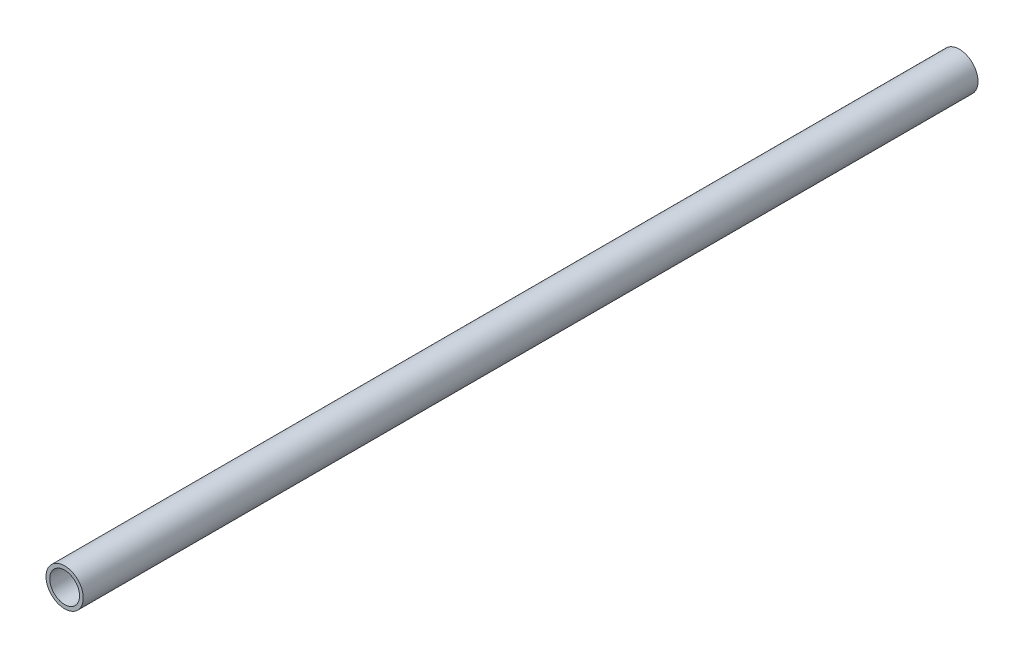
ISO-10303-21;
HEADER;
FILE_DESCRIPTION(('STEP AP214'),'2;1');
FILE_NAME('part.step','',(''),(''),'','','');
FILE_SCHEMA(('AUTOMOTIVE_DESIGN { 1 0 10303 214 1 1 1 1 }'));
ENDSEC;
DATA;
#1=APPLICATION_CONTEXT('core data for automotive mechanical design processes');
#2=APPLICATION_PROTOCOL_DEFINITION('international standard','automotive_design',2000,#1);
#3=PRODUCT_CONTEXT('',#1,'mechanical');
#4=PRODUCT('Part','Part','',(#3));
#5=PRODUCT_RELATED_PRODUCT_CATEGORY('part','',(#4));
#6=PRODUCT_DEFINITION_FORMATION('','',#4);
#7=PRODUCT_DEFINITION_CONTEXT('part definition',#1,'design');
#8=PRODUCT_DEFINITION('design','',#6,#7);
#9=PRODUCT_DEFINITION_SHAPE('','',#8);
#10=(LENGTH_UNIT() NAMED_UNIT(*) SI_UNIT(.MILLI.,.METRE.));
#11=(NAMED_UNIT(*) PLANE_ANGLE_UNIT() SI_UNIT($,.RADIAN.));
#12=(NAMED_UNIT(*) SI_UNIT($,.STERADIAN.) SOLID_ANGLE_UNIT());
#13=UNCERTAINTY_MEASURE_WITH_UNIT(LENGTH_MEASURE(1.E-05),#10,'distance_accuracy_value','');
#14=(GEOMETRIC_REPRESENTATION_CONTEXT(3) GLOBAL_UNCERTAINTY_ASSIGNED_CONTEXT((#13)) GLOBAL_UNIT_ASSIGNED_CONTEXT((#10,
#11,#12)) REPRESENTATION_CONTEXT('',''));
#15=CARTESIAN_POINT('',(0.,0.,0.));
#16=DIRECTION('',(0.,0.,1.));
#17=DIRECTION('',(1.,0.,0.));
#18=AXIS2_PLACEMENT_3D('',#15,#16,#17);
#19=CARTESIAN_POINT('',(0.,0.,152.4));
#20=DIRECTION('',(0.,0.,1.));
#21=DIRECTION('',(1.,0.,0.));
#22=AXIS2_PLACEMENT_3D('',#19,#20,#21);
#23=PLANE('',#22);
#24=CARTESIAN_POINT('',(0.,0.,152.4));
#25=DIRECTION('',(0.,0.,1.));
#26=DIRECTION('',(1.,0.,0.));
#27=AXIS2_PLACEMENT_3D('',#24,#25,#26);
#28=CIRCLE('',#27,6.35);
#29=CARTESIAN_POINT('',(-6.35,0.,152.4));
#30=VERTEX_POINT('',#29);
#31=EDGE_CURVE('E10',#30,#30,#28,.T.);
#32=ORIENTED_EDGE('',*,*,#31,.T.);
#33=EDGE_LOOP('',(#32));
#34=FACE_BOUND('',#33,.T.);
#35=CARTESIAN_POINT('',(0.,0.,152.4));
#36=DIRECTION('',(0.,0.,1.));
#37=DIRECTION('',(1.,0.,0.));
#38=AXIS2_PLACEMENT_3D('',#35,#36,#37);
#39=CIRCLE('',#38,5.08);
#40=CARTESIAN_POINT('',(-5.08,0.,152.4));
#41=VERTEX_POINT('',#40);
#42=EDGE_CURVE('E42',#41,#41,#39,.T.);
#43=ORIENTED_EDGE('',*,*,#42,.F.);
#44=EDGE_LOOP('',(#43));
#45=FACE_BOUND('',#44,.T.);
#46=ADVANCED_FACE('F31',(#34,#45),#23,.T.);
#47=CARTESIAN_POINT('',(0.,0.,-152.4));
#48=DIRECTION('',(0.,0.,1.));
#49=DIRECTION('',(1.,0.,0.));
#50=AXIS2_PLACEMENT_3D('',#47,#48,#49);
#51=PLANE('',#50);
#52=CARTESIAN_POINT('',(0.,0.,-152.4));
#53=DIRECTION('',(0.,0.,1.));
#54=DIRECTION('',(1.,0.,0.));
#55=AXIS2_PLACEMENT_3D('',#52,#53,#54);
#56=CIRCLE('',#55,6.35);
#57=CARTESIAN_POINT('',(-6.35,0.,-152.4));
#58=VERTEX_POINT('',#57);
#59=EDGE_CURVE('E35',#58,#58,#56,.T.);
#60=ORIENTED_EDGE('',*,*,#59,.F.);
#61=EDGE_LOOP('',(#60));
#62=FACE_BOUND('',#61,.T.);
#63=CARTESIAN_POINT('',(0.,0.,-152.4));
#64=DIRECTION('',(0.,0.,1.));
#65=DIRECTION('',(1.,0.,0.));
#66=AXIS2_PLACEMENT_3D('',#63,#64,#65);
#67=CIRCLE('',#66,5.08);
#68=CARTESIAN_POINT('',(-5.08,0.,-152.4));
#69=VERTEX_POINT('',#68);
#70=EDGE_CURVE('E44',#69,#69,#67,.T.);
#71=ORIENTED_EDGE('',*,*,#70,.T.);
#72=EDGE_LOOP('',(#71));
#73=FACE_BOUND('',#72,.T.);
#74=ADVANCED_FACE('F54',(#62,#73),#51,.F.);
#75=CARTESIAN_POINT('',(0.,0.,152.4));
#76=DIRECTION('',(0.,0.,-1.));
#77=DIRECTION('',(-1.,0.,0.));
#78=AXIS2_PLACEMENT_3D('',#75,#76,#77);
#79=CYLINDRICAL_SURFACE('',#78,6.35);
#80=CARTESIAN_POINT('',(-6.35,0.,152.4));
#81=CARTESIAN_POINT('',(-6.35,0.,149.225));
#82=CARTESIAN_POINT('',(-6.35,0.,146.05));
#83=CARTESIAN_POINT('',(-6.35,0.,139.7));
#84=CARTESIAN_POINT('',(-6.35,0.,136.525));
#85=CARTESIAN_POINT('',(-6.35,0.,130.175));
#86=CARTESIAN_POINT('',(-6.35,0.,127.));
#87=CARTESIAN_POINT('',(-6.35,0.,120.65));
#88=CARTESIAN_POINT('',(-6.35,0.,117.475));
#89=CARTESIAN_POINT('',(-6.35,0.,111.125));
#90=CARTESIAN_POINT('',(-6.35,0.,107.95));
#91=CARTESIAN_POINT('',(-6.35,0.,101.6));
#92=CARTESIAN_POINT('',(-6.35,0.,98.425));
#93=CARTESIAN_POINT('',(-6.35,0.,92.075));
#94=CARTESIAN_POINT('',(-6.35,0.,88.9));
#95=CARTESIAN_POINT('',(-6.35,0.,82.55));
#96=CARTESIAN_POINT('',(-6.35,0.,79.375));
#97=CARTESIAN_POINT('',(-6.35,0.,73.025));
#98=CARTESIAN_POINT('',(-6.35,0.,69.85));
#99=CARTESIAN_POINT('',(-6.35,0.,63.5));
#100=CARTESIAN_POINT('',(-6.35,0.,60.325));
#101=CARTESIAN_POINT('',(-6.35,0.,53.975));
#102=CARTESIAN_POINT('',(-6.35,0.,50.8));
#103=CARTESIAN_POINT('',(-6.35,0.,44.45));
#104=CARTESIAN_POINT('',(-6.35,0.,41.275));
#105=CARTESIAN_POINT('',(-6.35,0.,34.925));
#106=CARTESIAN_POINT('',(-6.35,0.,31.75));
#107=CARTESIAN_POINT('',(-6.35,0.,25.4));
#108=CARTESIAN_POINT('',(-6.35,0.,22.225));
#109=CARTESIAN_POINT('',(-6.35,0.,15.875));
#110=CARTESIAN_POINT('',(-6.35,0.,12.7));
#111=CARTESIAN_POINT('',(-6.35,0.,6.35));
#112=CARTESIAN_POINT('',(-6.35,0.,3.175));
#113=CARTESIAN_POINT('',(-6.35,0.,-3.175));
#114=CARTESIAN_POINT('',(-6.35,0.,-6.35));
#115=CARTESIAN_POINT('',(-6.35,0.,-12.7));
#116=CARTESIAN_POINT('',(-6.35,0.,-15.875));
#117=CARTESIAN_POINT('',(-6.35,0.,-22.225));
#118=CARTESIAN_POINT('',(-6.35,0.,-25.4));
#119=CARTESIAN_POINT('',(-6.35,0.,-31.75));
#120=CARTESIAN_POINT('',(-6.35,0.,-34.925));
#121=CARTESIAN_POINT('',(-6.35,0.,-41.275));
#122=CARTESIAN_POINT('',(-6.35,0.,-44.45));
#123=CARTESIAN_POINT('',(-6.35,0.,-50.8));
#124=CARTESIAN_POINT('',(-6.35,0.,-53.975));
#125=CARTESIAN_POINT('',(-6.35,0.,-60.325));
#126=CARTESIAN_POINT('',(-6.35,0.,-63.5));
#127=CARTESIAN_POINT('',(-6.35,0.,-69.85));
#128=CARTESIAN_POINT('',(-6.35,0.,-73.025));
#129=CARTESIAN_POINT('',(-6.35,0.,-79.375));
#130=CARTESIAN_POINT('',(-6.35,0.,-82.55));
#131=CARTESIAN_POINT('',(-6.35,0.,-88.9));
#132=CARTESIAN_POINT('',(-6.35,0.,-92.075));
#133=CARTESIAN_POINT('',(-6.35,0.,-98.425));
#134=CARTESIAN_POINT('',(-6.35,0.,-101.6));
#135=CARTESIAN_POINT('',(-6.35,0.,-107.95));
#136=CARTESIAN_POINT('',(-6.35,0.,-111.125));
#137=CARTESIAN_POINT('',(-6.35,0.,-117.475));
#138=CARTESIAN_POINT('',(-6.35,0.,-120.65));
#139=CARTESIAN_POINT('',(-6.35,0.,-127.));
#140=CARTESIAN_POINT('',(-6.35,0.,-130.175));
#141=CARTESIAN_POINT('',(-6.35,0.,-136.525));
#142=CARTESIAN_POINT('',(-6.35,0.,-139.7));
#143=CARTESIAN_POINT('',(-6.35,0.,-146.05));
#144=CARTESIAN_POINT('',(-6.35,0.,-149.225));
#145=CARTESIAN_POINT('',(-6.35,0.,-152.4));
#146=B_SPLINE_CURVE_WITH_KNOTS('',3,(#80,#81,#82,#83,#84,#85,#86,#87,#88,#89,#90,#91,#92,#93,
#94,#95,#96,#97,#98,#99,#100,#101,#102,#103,#104,#105,#106,#107,#108,#109,#110,#111,#112,#113,
#114,#115,#116,#117,#118,#119,#120,#121,#122,#123,#124,#125,#126,#127,#128,#129,#130,#131,#132,
#133,#134,#135,#136,#137,#138,#139,#140,#141,#142,#143,#144,#145),.UNSPECIFIED.,.F.,.F.,(4,2,2,
2,2,2,2,2,2,2,2,2,2,2,2,2,2,2,2,2,2,2,2,2,2,2,2,2,2,2,2,2,4),(0.,9.52500000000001,19.05,28.575,
38.1,47.625,57.15,66.675,76.2,85.725,95.25,104.775,114.3,123.825,133.35,142.875,152.4,161.925,
171.45,180.975,190.5,200.025,209.55,219.075,228.6,238.125,247.65,257.175,266.7,276.225,285.75,
295.275,304.8),.UNSPECIFIED.);
#147=EDGE_CURVE('BSEAM33',#30,#58,#146,.T.);
#148=ORIENTED_EDGE('',*,*,#31,.F.);
#149=ORIENTED_EDGE('',*,*,#59,.T.);
#150=ORIENTED_EDGE('',*,*,#147,.T.);
#151=ORIENTED_EDGE('',*,*,#147,.F.);
#152=EDGE_LOOP('',(#148,#150,#149,#151));
#153=FACE_BOUND('',#152,.T.);
#154=ADVANCED_FACE('F33',(#153),#79,.T.);
#155=CARTESIAN_POINT('',(0.,0.,152.4));
#156=DIRECTION('',(0.,0.,-1.));
#157=DIRECTION('',(-1.,0.,0.));
#158=AXIS2_PLACEMENT_3D('',#155,#156,#157);
#159=CYLINDRICAL_SURFACE('',#158,5.08);
#160=CARTESIAN_POINT('',(-5.08,0.,152.4));
#161=CARTESIAN_POINT('',(-5.08,0.,149.225));
#162=CARTESIAN_POINT('',(-5.08,0.,146.05));
#163=CARTESIAN_POINT('',(-5.08,0.,139.7));
#164=CARTESIAN_POINT('',(-5.08,0.,136.525));
#165=CARTESIAN_POINT('',(-5.08,0.,130.175));
#166=CARTESIAN_POINT('',(-5.08,0.,127.));
#167=CARTESIAN_POINT('',(-5.08,0.,120.65));
#168=CARTESIAN_POINT('',(-5.08,0.,117.475));
#169=CARTESIAN_POINT('',(-5.08,0.,111.125));
#170=CARTESIAN_POINT('',(-5.08,0.,107.95));
#171=CARTESIAN_POINT('',(-5.08,0.,101.6));
#172=CARTESIAN_POINT('',(-5.08,0.,98.425));
#173=CARTESIAN_POINT('',(-5.08,0.,92.075));
#174=CARTESIAN_POINT('',(-5.08,0.,88.9));
#175=CARTESIAN_POINT('',(-5.08,0.,82.55));
#176=CARTESIAN_POINT('',(-5.08,0.,79.375));
#177=CARTESIAN_POINT('',(-5.08,0.,73.025));
#178=CARTESIAN_POINT('',(-5.08,0.,69.85));
#179=CARTESIAN_POINT('',(-5.08,0.,63.5));
#180=CARTESIAN_POINT('',(-5.08,0.,60.325));
#181=CARTESIAN_POINT('',(-5.08,0.,53.975));
#182=CARTESIAN_POINT('',(-5.08,0.,50.8));
#183=CARTESIAN_POINT('',(-5.08,0.,44.45));
#184=CARTESIAN_POINT('',(-5.08,0.,41.275));
#185=CARTESIAN_POINT('',(-5.08,0.,34.925));
#186=CARTESIAN_POINT('',(-5.08,0.,31.75));
#187=CARTESIAN_POINT('',(-5.08,0.,25.4));
#188=CARTESIAN_POINT('',(-5.08,0.,22.225));
#189=CARTESIAN_POINT('',(-5.08,0.,15.875));
#190=CARTESIAN_POINT('',(-5.08,0.,12.7));
#191=CARTESIAN_POINT('',(-5.08,0.,6.34999999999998));
#192=CARTESIAN_POINT('',(-5.08,0.,3.17499999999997));
#193=CARTESIAN_POINT('',(-5.08,0.,-3.17500000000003));
#194=CARTESIAN_POINT('',(-5.08,0.,-6.35000000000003));
#195=CARTESIAN_POINT('',(-5.08,0.,-12.7));
#196=CARTESIAN_POINT('',(-5.08,0.,-15.875));
#197=CARTESIAN_POINT('',(-5.08,0.,-22.225));
#198=CARTESIAN_POINT('',(-5.08,0.,-25.4));
#199=CARTESIAN_POINT('',(-5.08,0.,-31.75));
#200=CARTESIAN_POINT('',(-5.08,0.,-34.925));
#201=CARTESIAN_POINT('',(-5.08,0.,-41.275));
#202=CARTESIAN_POINT('',(-5.08,0.,-44.45));
#203=CARTESIAN_POINT('',(-5.08,0.,-50.8));
#204=CARTESIAN_POINT('',(-5.08,0.,-53.975));
#205=CARTESIAN_POINT('',(-5.08,0.,-60.325));
#206=CARTESIAN_POINT('',(-5.08,0.,-63.5));
#207=CARTESIAN_POINT('',(-5.08,0.,-69.85));
#208=CARTESIAN_POINT('',(-5.08,0.,-73.025));
#209=CARTESIAN_POINT('',(-5.08,0.,-79.375));
#210=CARTESIAN_POINT('',(-5.08,0.,-82.5500000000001));
#211=CARTESIAN_POINT('',(-5.08,0.,-88.9));
#212=CARTESIAN_POINT('',(-5.08,0.,-92.0750000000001));
#213=CARTESIAN_POINT('',(-5.08,0.,-98.425));
#214=CARTESIAN_POINT('',(-5.08,0.,-101.6));
#215=CARTESIAN_POINT('',(-5.08,0.,-107.95));
#216=CARTESIAN_POINT('',(-5.08,0.,-111.125));
#217=CARTESIAN_POINT('',(-5.08,0.,-117.475));
#218=CARTESIAN_POINT('',(-5.08,0.,-120.65));
#219=CARTESIAN_POINT('',(-5.08,0.,-127.));
#220=CARTESIAN_POINT('',(-5.08,0.,-130.175));
#221=CARTESIAN_POINT('',(-5.08,0.,-136.525));
#222=CARTESIAN_POINT('',(-5.08,0.,-139.7));
#223=CARTESIAN_POINT('',(-5.08,0.,-146.05));
#224=CARTESIAN_POINT('',(-5.08,0.,-149.225));
#225=CARTESIAN_POINT('',(-5.08,0.,-152.4));
#226=B_SPLINE_CURVE_WITH_KNOTS('',3,(#160,#161,#162,#163,#164,#165,#166,#167,#168,#169,#170,
#171,#172,#173,#174,#175,#176,#177,#178,#179,#180,#181,#182,#183,#184,#185,#186,#187,#188,#189,
#190,#191,#192,#193,#194,#195,#196,#197,#198,#199,#200,#201,#202,#203,#204,#205,#206,#207,#208,
#209,#210,#211,#212,#213,#214,#215,#216,#217,#218,#219,#220,#221,#222,#223,#224,#225),
.UNSPECIFIED.,.F.,.F.,(4,2,2,2,2,2,2,2,2,2,2,2,2,2,2,2,2,2,2,2,2,2,2,2,2,2,2,2,2,2,2,2,4),(0.,
9.52499999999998,19.05,28.575,38.1,47.625,57.15,66.675,76.2,85.725,95.25,104.775,114.3,123.825,
133.35,142.875,152.4,161.925,171.45,180.975,190.5,200.025,209.55,219.075,228.6,238.125,247.65,
257.175,266.7,276.225,285.75,295.275,304.8),.UNSPECIFIED.);
#227=EDGE_CURVE('BSEAM50',#41,#69,#226,.T.);
#228=ORIENTED_EDGE('',*,*,#42,.T.);
#229=ORIENTED_EDGE('',*,*,#70,.F.);
#230=ORIENTED_EDGE('',*,*,#227,.T.);
#231=ORIENTED_EDGE('',*,*,#227,.F.);
#232=EDGE_LOOP('',(#228,#230,#229,#231));
#233=FACE_BOUND('',#232,.T.);
#234=ADVANCED_FACE('F50',(#233),#159,.F.);
#235=CLOSED_SHELL('',(#46,#74,#154,#234));
#236=MANIFOLD_SOLID_BREP('B2',#235);
#237=ADVANCED_BREP_SHAPE_REPRESENTATION('',(#18,#236),#14);
#238=SHAPE_DEFINITION_REPRESENTATION(#9,#237);
ENDSEC;
END-ISO-10303-21;
